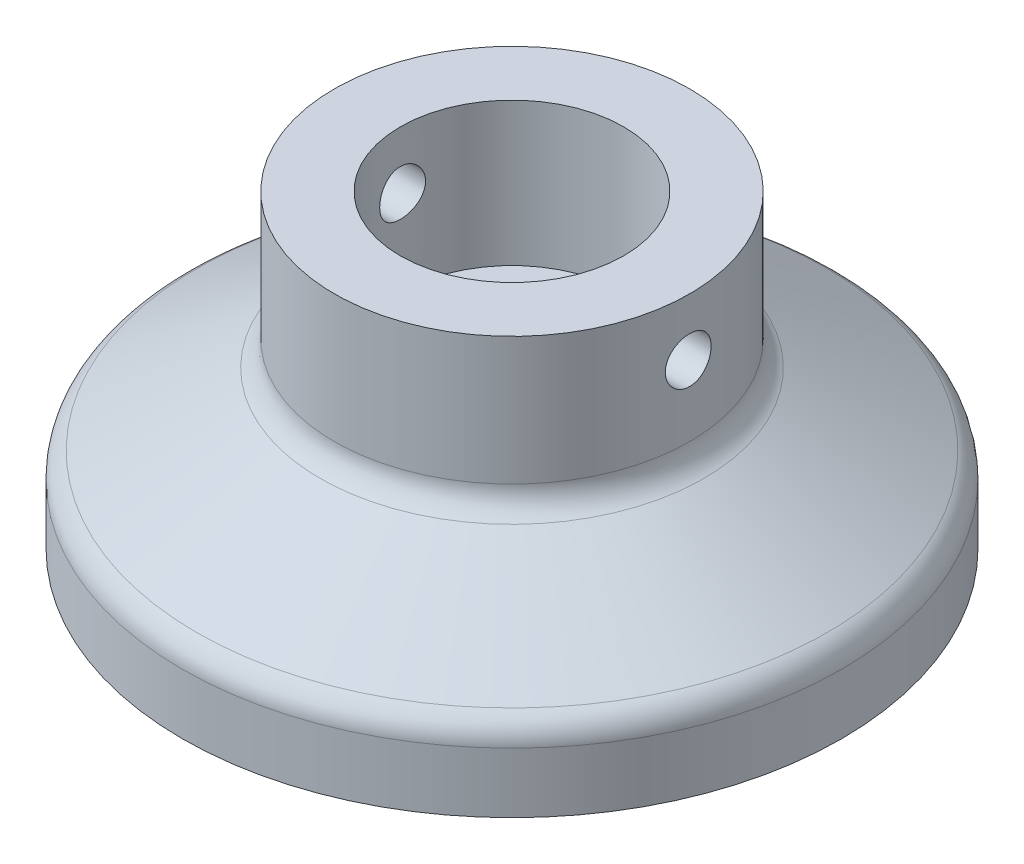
ISO-10303-21;
HEADER;
FILE_DESCRIPTION(('STEP AP214'),'2;1');
FILE_NAME('part.step','',(''),(''),'','','');
FILE_SCHEMA(('AUTOMOTIVE_DESIGN { 1 0 10303 214 1 1 1 1 }'));
ENDSEC;
DATA;
#1=APPLICATION_CONTEXT('core data for automotive mechanical design processes');
#2=APPLICATION_PROTOCOL_DEFINITION('international standard','automotive_design',2000,#1);
#3=PRODUCT_CONTEXT('',#1,'mechanical');
#4=PRODUCT('Part','Part','',(#3));
#5=PRODUCT_RELATED_PRODUCT_CATEGORY('part','',(#4));
#6=PRODUCT_DEFINITION_FORMATION('','',#4);
#7=PRODUCT_DEFINITION_CONTEXT('part definition',#1,'design');
#8=PRODUCT_DEFINITION('design','',#6,#7);
#9=PRODUCT_DEFINITION_SHAPE('','',#8);
#10=(LENGTH_UNIT() NAMED_UNIT(*) SI_UNIT(.MILLI.,.METRE.));
#11=(NAMED_UNIT(*) PLANE_ANGLE_UNIT() SI_UNIT($,.RADIAN.));
#12=(NAMED_UNIT(*) SI_UNIT($,.STERADIAN.) SOLID_ANGLE_UNIT());
#13=UNCERTAINTY_MEASURE_WITH_UNIT(LENGTH_MEASURE(1.E-05),#10,'distance_accuracy_value','');
#14=(GEOMETRIC_REPRESENTATION_CONTEXT(3) GLOBAL_UNCERTAINTY_ASSIGNED_CONTEXT((#13)) GLOBAL_UNIT_ASSIGNED_CONTEXT((#10,
#11,#12)) REPRESENTATION_CONTEXT('',''));
#15=CARTESIAN_POINT('',(0.,0.,0.));
#16=DIRECTION('',(0.,0.,1.));
#17=DIRECTION('',(1.,0.,0.));
#18=AXIS2_PLACEMENT_3D('',#15,#16,#17);
#19=CARTESIAN_POINT('',(0.,29.,0.));
#20=DIRECTION('',(0.,1.,0.));
#21=DIRECTION('',(0.,0.,1.));
#22=AXIS2_PLACEMENT_3D('',#19,#20,#21);
#23=PLANE('',#22);
#24=CARTESIAN_POINT('',(0.,29.,0.));
#25=DIRECTION('',(0.,-1.,0.));
#26=DIRECTION('',(0.,0.,-1.));
#27=AXIS2_PLACEMENT_3D('',#24,#25,#26);
#28=CIRCLE('',#27,19.5);
#29=CARTESIAN_POINT('',(0.,29.,-19.5));
#30=VERTEX_POINT('',#29);
#31=EDGE_CURVE('E54',#30,#30,#28,.T.);
#32=ORIENTED_EDGE('',*,*,#31,.F.);
#33=EDGE_LOOP('',(#32));
#34=FACE_BOUND('',#33,.T.);
#35=ADVANCED_FACE('F34',(#34),#23,.T.);
#36=CARTESIAN_POINT('',(0.,0.,0.));
#37=DIRECTION('',(0.,-1.,0.));
#38=DIRECTION('',(0.,0.,-1.));
#39=AXIS2_PLACEMENT_3D('',#36,#37,#38);
#40=CYLINDRICAL_SURFACE('',#39,19.5);
#41=CARTESIAN_POINT('',(-19.0853346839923,44.,-4.));
#42=CARTESIAN_POINT('',(-19.0853391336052,44.2221308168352,-3.99999193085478));
#43=CARTESIAN_POINT('',(-19.0892548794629,44.4443620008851,-3.98143384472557));
#44=CARTESIAN_POINT('',(-19.1044702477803,44.8825288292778,-3.9077588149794));
#45=CARTESIAN_POINT('',(-19.1157756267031,45.0984594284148,-3.85261336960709));
#46=CARTESIAN_POINT('',(-19.1444372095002,45.5176228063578,-3.70755288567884));
#47=CARTESIAN_POINT('',(-19.1617872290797,45.7208683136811,-3.61767337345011));
#48=CARTESIAN_POINT('',(-19.2005758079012,46.1093924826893,-3.40579458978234));
#49=CARTESIAN_POINT('',(-19.2220141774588,46.2946719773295,-3.28379680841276));
#50=CARTESIAN_POINT('',(-19.2669200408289,46.6447676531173,-3.0092107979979));
#51=CARTESIAN_POINT('',(-19.2904107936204,46.8092777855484,-2.8562360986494));
#52=CARTESIAN_POINT('',(-19.3365701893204,47.1104907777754,-2.5248734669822));
#53=CARTESIAN_POINT('',(-19.359238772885,47.247191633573,-2.34648370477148));
#54=CARTESIAN_POINT('',(-19.4014512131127,47.4900993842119,-1.96732132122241));
#55=CARTESIAN_POINT('',(-19.4209644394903,47.596014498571,-1.76635806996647));
#56=CARTESIAN_POINT('',(-19.4544058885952,47.772460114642,-1.34902021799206));
#57=CARTESIAN_POINT('',(-19.468334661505,47.8429941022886,-1.1326471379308));
#58=CARTESIAN_POINT('',(-19.4888734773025,47.9457199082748,-0.693809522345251));
#59=CARTESIAN_POINT('',(-19.4955821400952,47.9784288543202,-0.471470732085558));
#60=CARTESIAN_POINT('',(-19.5012657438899,48.0061904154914,-0.0243670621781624));
#61=CARTESIAN_POINT('',(-19.5002414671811,48.0012468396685,0.200397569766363));
#62=CARTESIAN_POINT('',(-19.4906507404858,47.9542340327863,0.642416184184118));
#63=CARTESIAN_POINT('',(-19.4821974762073,47.9127219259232,0.859732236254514));
#64=CARTESIAN_POINT('',(-19.4588265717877,47.7946352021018,1.28424679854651));
#65=CARTESIAN_POINT('',(-19.4439086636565,47.7180591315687,1.49144488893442));
#66=CARTESIAN_POINT('',(-19.4090993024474,47.5315082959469,1.89141991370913));
#67=CARTESIAN_POINT('',(-19.3891757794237,47.4213171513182,2.08409302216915));
#68=CARTESIAN_POINT('',(-19.3465484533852,47.1708245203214,2.4484193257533));
#69=CARTESIAN_POINT('',(-19.3238443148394,47.030519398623,2.62006997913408));
#70=CARTESIAN_POINT('',(-19.2776696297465,46.7207312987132,2.94078711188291));
#71=CARTESIAN_POINT('',(-19.2541926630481,46.5507607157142,3.08938205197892));
#72=CARTESIAN_POINT('',(-19.2095117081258,46.1880739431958,3.35603849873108));
#73=CARTESIAN_POINT('',(-19.1883077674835,45.9953572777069,3.47409936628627));
#74=CARTESIAN_POINT('',(-19.1505598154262,45.5919491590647,3.67651129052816));
#75=CARTESIAN_POINT('',(-19.1340268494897,45.3812166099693,3.76078263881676));
#76=CARTESIAN_POINT('',(-19.1076522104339,44.948164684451,3.89258150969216));
#77=CARTESIAN_POINT('',(-19.0978096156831,44.7258469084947,3.94011409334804));
#78=CARTESIAN_POINT('',(-19.0861156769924,44.2802183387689,3.99637437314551));
#79=CARTESIAN_POINT('',(-19.0841238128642,44.0569972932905,4.00578450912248));
#80=CARTESIAN_POINT('',(-19.0879791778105,43.6121753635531,3.98737214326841));
#81=CARTESIAN_POINT('',(-19.0938259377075,43.3905743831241,3.95955186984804));
#82=CARTESIAN_POINT('',(-19.1125678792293,42.9575986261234,3.86805775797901));
#83=CARTESIAN_POINT('',(-19.125390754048,42.7461427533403,3.80475152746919));
#84=CARTESIAN_POINT('',(-19.1565762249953,42.3368389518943,3.64447690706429));
#85=CARTESIAN_POINT('',(-19.1749392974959,42.1389921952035,3.54750562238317));
#86=CARTESIAN_POINT('',(-19.2154499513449,41.7595453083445,3.32111974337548));
#87=CARTESIAN_POINT('',(-19.2376458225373,41.5782041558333,3.1912798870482));
#88=CARTESIAN_POINT('',(-19.2831900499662,41.2396344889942,2.90340662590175));
#89=CARTESIAN_POINT('',(-19.3065385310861,41.0824085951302,2.74537016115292));
#90=CARTESIAN_POINT('',(-19.3522151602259,40.7939287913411,2.40251958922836));
#91=CARTESIAN_POINT('',(-19.374520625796,40.6631373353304,2.21731284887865));
#92=CARTESIAN_POINT('',(-19.4151976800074,40.4345263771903,1.82715915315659));
#93=CARTESIAN_POINT('',(-19.4335694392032,40.3367054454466,1.62221305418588));
#94=CARTESIAN_POINT('',(-19.4642125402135,40.1774784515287,1.19958764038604));
#95=CARTESIAN_POINT('',(-19.4765195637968,40.1158589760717,0.981991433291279));
#96=CARTESIAN_POINT('',(-19.4937999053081,40.0301102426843,0.539258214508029));
#97=CARTESIAN_POINT('',(-19.4987741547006,40.0059762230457,0.314122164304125));
#98=CARTESIAN_POINT('',(-19.5008049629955,39.9960758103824,-0.132890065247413));
#99=CARTESIAN_POINT('',(-19.4980047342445,40.0096154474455,-0.354750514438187));
#100=CARTESIAN_POINT('',(-19.4851038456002,40.0731404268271,-0.792962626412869));
#101=CARTESIAN_POINT('',(-19.475003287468,40.1231252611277,-1.00931436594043));
#102=CARTESIAN_POINT('',(-19.4486424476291,40.2578067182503,-1.42990738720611));
#103=CARTESIAN_POINT('',(-19.4323976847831,40.3424159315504,-1.63417769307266));
#104=CARTESIAN_POINT('',(-19.3954936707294,40.5438545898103,-2.02572024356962));
#105=CARTESIAN_POINT('',(-19.3748340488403,40.6606867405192,-2.21299105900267));
#106=CARTESIAN_POINT('',(-19.3309282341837,40.9255750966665,-2.56863801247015));
#107=CARTESIAN_POINT('',(-19.3076442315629,41.0741255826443,-2.73664137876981));
#108=CARTESIAN_POINT('',(-19.2613327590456,41.3972230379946,-3.04557393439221));
#109=CARTESIAN_POINT('',(-19.2383053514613,41.5717761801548,-3.18649667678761));
#110=CARTESIAN_POINT('',(-19.1948231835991,41.9443223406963,-3.4388058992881));
#111=CARTESIAN_POINT('',(-19.1744008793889,42.1425607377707,-3.54983592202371));
#112=CARTESIAN_POINT('',(-19.1388405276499,42.5552479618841,-3.73683222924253));
#113=CARTESIAN_POINT('',(-19.123697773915,42.769682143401,-3.8128297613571));
#114=CARTESIAN_POINT('',(-19.1033751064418,43.1537781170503,-3.91317471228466));
#115=CARTESIAN_POINT('',(-19.0966526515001,43.3212761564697,-3.94567484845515));
#116=CARTESIAN_POINT('',(-19.0876308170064,43.6591631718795,-3.98909017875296));
#117=CARTESIAN_POINT('',(-19.0853312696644,43.8295520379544,-4.00000619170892));
#118=CARTESIAN_POINT('',(-19.0853346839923,44.,-4.));
#119=B_SPLINE_CURVE_WITH_KNOTS('',3,(#41,#42,#43,#44,#45,#46,#47,#48,#49,#50,#51,#52,#53,#54,
#55,#56,#57,#58,#59,#60,#61,#62,#63,#64,#65,#66,#67,#68,#69,#70,#71,#72,#73,#74,#75,#76,#77,#78,
#79,#80,#81,#82,#83,#84,#85,#86,#87,#88,#89,#90,#91,#92,#93,#94,#95,#96,#97,#98,#99,#100,#101,
#102,#103,#104,#105,#106,#107,#108,#109,#110,#111,#112,#113,#114,#115,#116,#117,#118),
.UNSPECIFIED.,.T.,.F.,(4,2,2,2,2,2,2,2,2,2,2,2,2,2,2,2,2,2,2,2,2,2,2,2,2,2,2,2,2,2,2,2,2,2,2,2,
2,2,4),(0.,0.665768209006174,1.33205566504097,1.99766343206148,2.66324032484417,
3.33769854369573,4.01220534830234,4.69291078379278,5.3735491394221,6.04476778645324,
6.7159185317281,7.37701773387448,8.03814434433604,8.70361977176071,9.36917557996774,
10.0469286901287,10.7246959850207,11.4040528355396,12.0833160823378,12.7503644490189,
13.417372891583,14.0775960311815,14.7378759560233,15.4071793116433,16.0765553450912,
16.7567848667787,17.4369848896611,18.1131337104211,18.7891966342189,19.4528889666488,
20.116572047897,20.7785898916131,21.4406633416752,22.1139249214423,22.7873465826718,
23.4684746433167,24.1489939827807,24.6598782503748,25.1707431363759),.UNSPECIFIED.);
#120=CARTESIAN_POINT('',(-19.0853346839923,44.,-4.));
#121=VERTEX_POINT('',#120);
#122=EDGE_CURVE('E88',#121,#121,#119,.T.);
#123=ORIENTED_EDGE('',*,*,#122,.F.);
#124=EDGE_LOOP('',(#123));
#125=FACE_BOUND('',#124,.T.);
#126=CARTESIAN_POINT('',(19.0853346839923,44.,-4.));
#127=CARTESIAN_POINT('',(19.0853391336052,43.7778691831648,-3.99999193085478));
#128=CARTESIAN_POINT('',(19.0892548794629,43.5556379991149,-3.98143384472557));
#129=CARTESIAN_POINT('',(19.1044702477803,43.1174711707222,-3.9077588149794));
#130=CARTESIAN_POINT('',(19.1157756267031,42.9015405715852,-3.85261336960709));
#131=CARTESIAN_POINT('',(19.1444372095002,42.4823771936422,-3.70755288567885));
#132=CARTESIAN_POINT('',(19.1617872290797,42.2791316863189,-3.61767337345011));
#133=CARTESIAN_POINT('',(19.2005758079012,41.8906075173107,-3.40579458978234));
#134=CARTESIAN_POINT('',(19.2220141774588,41.7053280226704,-3.28379680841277));
#135=CARTESIAN_POINT('',(19.2669200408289,41.3552323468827,-3.0092107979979));
#136=CARTESIAN_POINT('',(19.2904107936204,41.1907222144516,-2.8562360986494));
#137=CARTESIAN_POINT('',(19.3365701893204,40.8895092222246,-2.5248734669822));
#138=CARTESIAN_POINT('',(19.359238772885,40.752808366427,-2.34648370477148));
#139=CARTESIAN_POINT('',(19.4014512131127,40.5099006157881,-1.96732132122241));
#140=CARTESIAN_POINT('',(19.4209644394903,40.403985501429,-1.76635806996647));
#141=CARTESIAN_POINT('',(19.4544058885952,40.227539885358,-1.34902021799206));
#142=CARTESIAN_POINT('',(19.468334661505,40.1570058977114,-1.1326471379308));
#143=CARTESIAN_POINT('',(19.4888734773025,40.0542800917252,-0.693809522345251));
#144=CARTESIAN_POINT('',(19.4955821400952,40.0215711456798,-0.471470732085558));
#145=CARTESIAN_POINT('',(19.5012657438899,39.9938095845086,-0.0243670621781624));
#146=CARTESIAN_POINT('',(19.5002414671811,39.9987531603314,0.200397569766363));
#147=CARTESIAN_POINT('',(19.4906507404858,40.0457659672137,0.642416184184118));
#148=CARTESIAN_POINT('',(19.4821974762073,40.0872780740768,0.859732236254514));
#149=CARTESIAN_POINT('',(19.4588265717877,40.2053647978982,1.28424679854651));
#150=CARTESIAN_POINT('',(19.4439086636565,40.2819408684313,1.49144488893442));
#151=CARTESIAN_POINT('',(19.4090993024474,40.4684917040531,1.89141991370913));
#152=CARTESIAN_POINT('',(19.3891757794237,40.5786828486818,2.08409302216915));
#153=CARTESIAN_POINT('',(19.3465484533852,40.8291754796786,2.4484193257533));
#154=CARTESIAN_POINT('',(19.3238443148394,40.969480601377,2.62006997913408));
#155=CARTESIAN_POINT('',(19.2776696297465,41.2792687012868,2.94078711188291));
#156=CARTESIAN_POINT('',(19.2541926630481,41.4492392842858,3.08938205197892));
#157=CARTESIAN_POINT('',(19.2095117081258,41.8119260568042,3.35603849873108));
#158=CARTESIAN_POINT('',(19.1883077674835,42.0046427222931,3.47409936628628));
#159=CARTESIAN_POINT('',(19.1505598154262,42.4080508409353,3.67651129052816));
#160=CARTESIAN_POINT('',(19.1340268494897,42.6187833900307,3.76078263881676));
#161=CARTESIAN_POINT('',(19.1076522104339,43.051835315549,3.89258150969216));
#162=CARTESIAN_POINT('',(19.0978096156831,43.2741530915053,3.94011409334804));
#163=CARTESIAN_POINT('',(19.0861156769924,43.7197816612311,3.99637437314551));
#164=CARTESIAN_POINT('',(19.0841238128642,43.9430027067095,4.00578450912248));
#165=CARTESIAN_POINT('',(19.0879791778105,44.3878246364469,3.98737214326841));
#166=CARTESIAN_POINT('',(19.0938259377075,44.6094256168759,3.95955186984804));
#167=CARTESIAN_POINT('',(19.1125678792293,45.0424013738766,3.86805775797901));
#168=CARTESIAN_POINT('',(19.125390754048,45.2538572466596,3.80475152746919));
#169=CARTESIAN_POINT('',(19.1565762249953,45.6631610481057,3.64447690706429));
#170=CARTESIAN_POINT('',(19.1749392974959,45.8610078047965,3.54750562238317));
#171=CARTESIAN_POINT('',(19.2154499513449,46.2404546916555,3.32111974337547));
#172=CARTESIAN_POINT('',(19.2376458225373,46.4217958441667,3.1912798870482));
#173=CARTESIAN_POINT('',(19.2831900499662,46.7603655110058,2.90340662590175));
#174=CARTESIAN_POINT('',(19.3065385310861,46.9175914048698,2.74537016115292));
#175=CARTESIAN_POINT('',(19.3522151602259,47.2060712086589,2.40251958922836));
#176=CARTESIAN_POINT('',(19.374520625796,47.3368626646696,2.21731284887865));
#177=CARTESIAN_POINT('',(19.4151976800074,47.5654736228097,1.82715915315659));
#178=CARTESIAN_POINT('',(19.4335694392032,47.6632945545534,1.62221305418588));
#179=CARTESIAN_POINT('',(19.4642125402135,47.8225215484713,1.19958764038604));
#180=CARTESIAN_POINT('',(19.4765195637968,47.8841410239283,0.981991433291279));
#181=CARTESIAN_POINT('',(19.4937999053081,47.9698897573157,0.539258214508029));
#182=CARTESIAN_POINT('',(19.4987741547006,47.9940237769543,0.314122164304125));
#183=CARTESIAN_POINT('',(19.5008049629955,48.0039241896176,-0.132890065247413));
#184=CARTESIAN_POINT('',(19.4980047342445,47.9903845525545,-0.354750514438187));
#185=CARTESIAN_POINT('',(19.4851038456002,47.9268595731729,-0.792962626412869));
#186=CARTESIAN_POINT('',(19.475003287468,47.8768747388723,-1.00931436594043));
#187=CARTESIAN_POINT('',(19.4486424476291,47.7421932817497,-1.42990738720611));
#188=CARTESIAN_POINT('',(19.4323976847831,47.6575840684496,-1.63417769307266));
#189=CARTESIAN_POINT('',(19.3954936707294,47.4561454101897,-2.02572024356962));
#190=CARTESIAN_POINT('',(19.3748340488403,47.3393132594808,-2.21299105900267));
#191=CARTESIAN_POINT('',(19.3309282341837,47.0744249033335,-2.56863801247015));
#192=CARTESIAN_POINT('',(19.3076442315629,46.9258744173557,-2.73664137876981));
#193=CARTESIAN_POINT('',(19.2613327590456,46.6027769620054,-3.04557393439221));
#194=CARTESIAN_POINT('',(19.2383053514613,46.4282238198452,-3.18649667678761));
#195=CARTESIAN_POINT('',(19.1948231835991,46.0556776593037,-3.4388058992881));
#196=CARTESIAN_POINT('',(19.1744008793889,45.8574392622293,-3.5498359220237));
#197=CARTESIAN_POINT('',(19.1388405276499,45.4447520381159,-3.73683222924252));
#198=CARTESIAN_POINT('',(19.123697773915,45.230317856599,-3.8128297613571));
#199=CARTESIAN_POINT('',(19.1033751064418,44.8462218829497,-3.91317471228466));
#200=CARTESIAN_POINT('',(19.0966526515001,44.6787238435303,-3.94567484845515));
#201=CARTESIAN_POINT('',(19.0876308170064,44.3408368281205,-3.98909017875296));
#202=CARTESIAN_POINT('',(19.0853312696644,44.1704479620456,-4.00000619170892));
#203=CARTESIAN_POINT('',(19.0853346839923,44.,-4.));
#204=B_SPLINE_CURVE_WITH_KNOTS('',3,(#126,#127,#128,#129,#130,#131,#132,#133,#134,#135,#136,
#137,#138,#139,#140,#141,#142,#143,#144,#145,#146,#147,#148,#149,#150,#151,#152,#153,#154,#155,
#156,#157,#158,#159,#160,#161,#162,#163,#164,#165,#166,#167,#168,#169,#170,#171,#172,#173,#174,
#175,#176,#177,#178,#179,#180,#181,#182,#183,#184,#185,#186,#187,#188,#189,#190,#191,#192,#193,
#194,#195,#196,#197,#198,#199,#200,#201,#202,#203),.UNSPECIFIED.,.T.,.F.,(4,2,2,2,2,2,2,2,2,2,2,
2,2,2,2,2,2,2,2,2,2,2,2,2,2,2,2,2,2,2,2,2,2,2,2,2,2,2,4),(0.,0.665768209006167,1.33205566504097,
1.99766343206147,2.66324032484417,3.33769854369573,4.01220534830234,4.69291078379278,
5.3735491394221,6.04476778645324,6.7159185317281,7.37701773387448,8.03814434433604,
8.70361977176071,9.36917557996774,10.0469286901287,10.7246959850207,11.4040528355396,
12.0833160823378,12.7503644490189,13.417372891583,14.0775960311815,14.7378759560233,
15.4071793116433,16.0765553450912,16.7567848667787,17.4369848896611,18.1131337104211,
18.7891966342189,19.4528889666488,20.116572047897,20.7785898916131,21.4406633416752,
22.1139249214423,22.7873465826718,23.4684746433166,24.1489939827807,24.6598782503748,
25.1707431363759),.UNSPECIFIED.);
#205=CARTESIAN_POINT('',(19.0853346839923,44.,-4.));
#206=VERTEX_POINT('',#205);
#207=EDGE_CURVE('E62',#206,#206,#204,.T.);
#208=ORIENTED_EDGE('',*,*,#207,.F.);
#209=EDGE_LOOP('',(#208));
#210=FACE_BOUND('',#209,.T.);
#211=ORIENTED_EDGE('',*,*,#31,.T.);
#212=EDGE_LOOP('',(#211));
#213=FACE_BOUND('',#212,.T.);
#214=CARTESIAN_POINT('',(0.,54.,0.));
#215=DIRECTION('',(0.,-1.,0.));
#216=DIRECTION('',(0.,0.,-1.));
#217=AXIS2_PLACEMENT_3D('',#214,#215,#216);
#218=CIRCLE('',#217,19.5);
#219=CARTESIAN_POINT('',(0.,54.,-19.5));
#220=VERTEX_POINT('',#219);
#221=EDGE_CURVE('E127',#220,#220,#218,.T.);
#222=ORIENTED_EDGE('',*,*,#221,.F.);
#223=EDGE_LOOP('',(#222));
#224=FACE_BOUND('',#223,.T.);
#225=ADVANCED_FACE('F92',(#125,#210,#213,#224),#40,.F.);
#226=CARTESIAN_POINT('',(19.5,54.,0.));
#227=DIRECTION('',(0.,1.,0.));
#228=DIRECTION('',(0.,0.,1.));
#229=AXIS2_PLACEMENT_3D('',#226,#227,#228);
#230=PLANE('',#229);
#231=ORIENTED_EDGE('',*,*,#221,.T.);
#232=EDGE_LOOP('',(#231));
#233=FACE_BOUND('',#232,.T.);
#234=CARTESIAN_POINT('',(0.,54.,0.));
#235=DIRECTION('',(0.,-1.,0.));
#236=DIRECTION('',(0.,0.,-1.));
#237=AXIS2_PLACEMENT_3D('',#234,#235,#236);
#238=CIRCLE('',#237,31.);
#239=CARTESIAN_POINT('',(0.,54.,-31.));
#240=VERTEX_POINT('',#239);
#241=EDGE_CURVE('E123',#240,#240,#238,.T.);
#242=ORIENTED_EDGE('',*,*,#241,.F.);
#243=EDGE_LOOP('',(#242));
#244=FACE_BOUND('',#243,.T.);
#245=ADVANCED_FACE('F96',(#233,#244),#230,.T.);
#246=CARTESIAN_POINT('',(0.,0.,0.));
#247=DIRECTION('',(0.,-1.,0.));
#248=DIRECTION('',(0.,0.,-1.));
#249=AXIS2_PLACEMENT_3D('',#246,#247,#248);
#250=CYLINDRICAL_SURFACE('',#249,31.);
#251=CARTESIAN_POINT('',(0.,31.6727874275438,0.));
#252=DIRECTION('',(0.,-1.,0.));
#253=DIRECTION('',(0.,0.,-1.));
#254=AXIS2_PLACEMENT_3D('',#251,#252,#253);
#255=CIRCLE('',#254,31.);
#256=CARTESIAN_POINT('',(0.,31.6727874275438,-31.));
#257=VERTEX_POINT('',#256);
#258=EDGE_CURVE('E11',#257,#257,#255,.F.);
#259=ORIENTED_EDGE('',*,*,#258,.T.);
#260=EDGE_LOOP('',(#259));
#261=FACE_BOUND('',#260,.T.);
#262=CARTESIAN_POINT('',(-30.7408522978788,44.,-4.));
#263=CARTESIAN_POINT('',(-30.7408556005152,43.7763239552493,-3.99999052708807));
#264=CARTESIAN_POINT('',(-30.7433199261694,43.5525095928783,-3.98117505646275));
#265=CARTESIAN_POINT('',(-30.7529068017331,43.1111139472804,-3.9064163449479));
#266=CARTESIAN_POINT('',(-30.7600341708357,42.8935393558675,-3.85043469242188));
#267=CARTESIAN_POINT('',(-30.7781267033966,42.4710776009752,-3.7030251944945));
#268=CARTESIAN_POINT('',(-30.7890892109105,42.266181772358,-3.6116218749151));
#269=CARTESIAN_POINT('',(-30.8136136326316,41.8746735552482,-3.39601698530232));
#270=CARTESIAN_POINT('',(-30.8271751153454,41.6880581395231,-3.27182085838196));
#271=CARTESIAN_POINT('',(-30.8554598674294,41.3372599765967,-2.99336401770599));
#272=CARTESIAN_POINT('',(-30.8701889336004,41.1732018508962,-2.83894687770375));
#273=CARTESIAN_POINT('',(-30.8990971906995,40.873252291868,-2.50476828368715));
#274=CARTESIAN_POINT('',(-30.9132763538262,40.7373622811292,-2.32500555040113));
#275=CARTESIAN_POINT('',(-30.9395467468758,40.4971572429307,-1.94445279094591));
#276=CARTESIAN_POINT('',(-30.9516304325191,40.3929553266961,-1.74359080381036));
#277=CARTESIAN_POINT('',(-30.9722845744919,40.2198090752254,-1.32703620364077));
#278=CARTESIAN_POINT('',(-30.9808551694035,40.1508633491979,-1.11134417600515));
#279=CARTESIAN_POINT('',(-30.9934766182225,40.0505598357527,-0.67252836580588));
#280=CARTESIAN_POINT('',(-30.9975524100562,40.01899458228,-0.44945273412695));
#281=CARTESIAN_POINT('',(-31.0008102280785,39.9937048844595,-0.0011359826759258));
#282=CARTESIAN_POINT('',(-30.9999924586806,39.9999788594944,0.224105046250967));
#283=CARTESIAN_POINT('',(-30.9935754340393,40.0500236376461,0.668946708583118));
#284=CARTESIAN_POINT('',(-30.9880046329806,40.0935713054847,0.888572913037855));
#285=CARTESIAN_POINT('',(-30.9727393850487,40.2165782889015,1.31737376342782));
#286=CARTESIAN_POINT('',(-30.9630448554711,40.2960383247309,1.52654819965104));
#287=CARTESIAN_POINT('',(-30.9405724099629,40.4888504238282,1.92919629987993));
#288=CARTESIAN_POINT('',(-30.9277857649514,40.6022986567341,2.12262340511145));
#289=CARTESIAN_POINT('',(-30.9005588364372,40.8597967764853,2.48777829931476));
#290=CARTESIAN_POINT('',(-30.886118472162,41.0038481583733,2.65950502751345));
#291=CARTESIAN_POINT('',(-30.8570752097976,41.3197122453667,2.9776960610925));
#292=CARTESIAN_POINT('',(-30.8424718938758,41.4917194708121,3.12396729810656));
#293=CARTESIAN_POINT('',(-30.8148522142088,41.8579454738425,3.38559366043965));
#294=CARTESIAN_POINT('',(-30.8018358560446,42.0521643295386,3.50094867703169));
#295=CARTESIAN_POINT('',(-30.7788640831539,42.4574768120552,3.69748136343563));
#296=CARTESIAN_POINT('',(-30.7689101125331,42.6685783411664,3.77864291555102));
#297=CARTESIAN_POINT('',(-30.7532178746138,43.1015714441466,3.90431016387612));
#298=CARTESIAN_POINT('',(-30.7474793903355,43.3234624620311,3.94881774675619));
#299=CARTESIAN_POINT('',(-30.7409077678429,43.7700288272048,3.99965660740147));
#300=CARTESIAN_POINT('',(-30.7400396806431,43.9946727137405,4.00625988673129));
#301=CARTESIAN_POINT('',(-30.7432146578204,44.4418635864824,3.98182098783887));
#302=CARTESIAN_POINT('',(-30.7472576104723,44.6644106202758,3.95077966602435));
#303=CARTESIAN_POINT('',(-30.7597672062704,45.100271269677,3.85216198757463));
#304=CARTESIAN_POINT('',(-30.7682178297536,45.3136153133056,3.78471790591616));
#305=CARTESIAN_POINT('',(-30.7885775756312,45.7259669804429,3.61534557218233));
#306=CARTESIAN_POINT('',(-30.8004868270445,45.924974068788,3.51341603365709));
#307=CARTESIAN_POINT('',(-30.8265054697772,46.3042316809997,3.27729970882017));
#308=CARTESIAN_POINT('',(-30.8406268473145,46.4843705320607,3.14293489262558));
#309=CARTESIAN_POINT('',(-30.86944122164,46.819637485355,2.84601317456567));
#310=CARTESIAN_POINT('',(-30.8841342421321,46.9747645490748,2.68345510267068));
#311=CARTESIAN_POINT('',(-30.9125440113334,47.2565631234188,2.33357163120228));
#312=CARTESIAN_POINT('',(-30.9262542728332,47.3830556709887,2.14610149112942));
#313=CARTESIAN_POINT('',(-30.9510561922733,47.6027549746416,1.7524174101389));
#314=CARTESIAN_POINT('',(-30.9621479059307,47.6959624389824,1.54620386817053));
#315=CARTESIAN_POINT('',(-30.9804342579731,47.8461516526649,1.1214759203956));
#316=CARTESIAN_POINT('',(-30.9876399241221,47.9032359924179,0.902998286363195));
#317=CARTESIAN_POINT('',(-30.9973881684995,47.9798920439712,0.459459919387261));
#318=CARTESIAN_POINT('',(-30.9999309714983,47.9994655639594,0.234399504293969));
#319=CARTESIAN_POINT('',(-31.0000657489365,48.000509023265,-0.214170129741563));
#320=CARTESIAN_POINT('',(-30.9976935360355,47.9822545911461,-0.437678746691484));
#321=CARTESIAN_POINT('',(-30.9883361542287,47.9087451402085,-0.878422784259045));
#322=CARTESIAN_POINT('',(-30.9813509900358,47.8534901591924,-1.09565821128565));
#323=CARTESIAN_POINT('',(-30.9635489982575,47.707636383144,-1.51764724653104));
#324=CARTESIAN_POINT('',(-30.9527336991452,47.6170516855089,-1.72240579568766));
#325=CARTESIAN_POINT('',(-30.9284675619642,47.403138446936,-2.11385938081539));
#326=CARTESIAN_POINT('',(-30.9150166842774,47.279809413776,-2.3005541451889));
#327=CARTESIAN_POINT('',(-30.8868630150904,47.0028918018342,-2.65198741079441));
#328=CARTESIAN_POINT('',(-30.8721521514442,46.8490983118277,-2.81656381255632));
#329=CARTESIAN_POINT('',(-30.8432005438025,46.5160445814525,-3.11767933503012));
#330=CARTESIAN_POINT('',(-30.8289599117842,46.3367783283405,-3.25421181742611));
#331=CARTESIAN_POINT('',(-30.8024986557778,45.9570178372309,-3.49584858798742));
#332=CARTESIAN_POINT('',(-30.7902865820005,45.756439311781,-3.60082128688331));
#333=CARTESIAN_POINT('',(-30.7693652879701,45.3404524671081,-3.77544209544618));
#334=CARTESIAN_POINT('',(-30.7606522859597,45.1250604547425,-3.8451283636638));
#335=CARTESIAN_POINT('',(-30.7498160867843,44.7571453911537,-3.93064302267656));
#336=CARTESIAN_POINT('',(-30.7464715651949,44.6069364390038,-3.95661413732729));
#337=CARTESIAN_POINT('',(-30.741988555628,44.3045063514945,-3.99129577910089));
#338=CARTESIAN_POINT('',(-30.7408500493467,44.152285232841,-4.00000644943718));
#339=CARTESIAN_POINT('',(-30.7408522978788,44.,-4.));
#340=B_SPLINE_CURVE_WITH_KNOTS('',3,(#262,#263,#264,#265,#266,#267,#268,#269,#270,#271,#272,
#273,#274,#275,#276,#277,#278,#279,#280,#281,#282,#283,#284,#285,#286,#287,#288,#289,#290,#291,
#292,#293,#294,#295,#296,#297,#298,#299,#300,#301,#302,#303,#304,#305,#306,#307,#308,#309,#310,
#311,#312,#313,#314,#315,#316,#317,#318,#319,#320,#321,#322,#323,#324,#325,#326,#327,#328,#329,
#330,#331,#332,#333,#334,#335,#336,#337,#338,#339),.UNSPECIFIED.,.T.,.F.,(4,2,2,2,2,2,2,2,2,2,2,
2,2,2,2,2,2,2,2,2,2,2,2,2,2,2,2,2,2,2,2,2,2,2,2,2,2,2,4),(0.,0.670471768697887,1.34163755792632,
2.01233946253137,2.68293011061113,3.35708824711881,4.03128042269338,4.70785163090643,
5.38439614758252,6.05716789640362,6.72991154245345,7.39865581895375,8.0674135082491,
8.73808161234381,9.40878248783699,10.0843674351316,10.75995475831,11.4358601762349,
12.111730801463,12.7827452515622,13.4537444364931,14.122321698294,14.7909239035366,
15.4632828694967,16.135669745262,16.8121495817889,17.4886150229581,18.1631505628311,
18.8376535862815,19.5072592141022,20.1768641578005,20.8462021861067,21.5155502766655,
22.1895635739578,22.8637362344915,23.5406820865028,24.2168943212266,24.6733750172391,
25.1298519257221),.UNSPECIFIED.);
#341=CARTESIAN_POINT('',(-30.7408522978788,44.,-4.));
#342=VERTEX_POINT('',#341);
#343=EDGE_CURVE('E55',#342,#342,#340,.T.);
#344=ORIENTED_EDGE('',*,*,#343,.F.);
#345=EDGE_LOOP('',(#344));
#346=FACE_BOUND('',#345,.T.);
#347=CARTESIAN_POINT('',(30.7408522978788,44.,-4.));
#348=CARTESIAN_POINT('',(30.7408556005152,44.2236760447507,-3.99999052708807));
#349=CARTESIAN_POINT('',(30.7433199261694,44.4474904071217,-3.98117505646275));
#350=CARTESIAN_POINT('',(30.7529068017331,44.8888860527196,-3.9064163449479));
#351=CARTESIAN_POINT('',(30.7600341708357,45.1064606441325,-3.85043469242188));
#352=CARTESIAN_POINT('',(30.7781267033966,45.5289223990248,-3.7030251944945));
#353=CARTESIAN_POINT('',(30.7890892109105,45.733818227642,-3.6116218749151));
#354=CARTESIAN_POINT('',(30.8136136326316,46.1253264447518,-3.39601698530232));
#355=CARTESIAN_POINT('',(30.8271751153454,46.3119418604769,-3.27182085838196));
#356=CARTESIAN_POINT('',(30.8554598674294,46.6627400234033,-2.99336401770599));
#357=CARTESIAN_POINT('',(30.8701889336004,46.8267981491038,-2.83894687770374));
#358=CARTESIAN_POINT('',(30.8990971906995,47.126747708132,-2.50476828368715));
#359=CARTESIAN_POINT('',(30.9132763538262,47.2626377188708,-2.32500555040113));
#360=CARTESIAN_POINT('',(30.9395467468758,47.5028427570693,-1.94445279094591));
#361=CARTESIAN_POINT('',(30.9516304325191,47.6070446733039,-1.74359080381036));
#362=CARTESIAN_POINT('',(30.9722845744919,47.7801909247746,-1.32703620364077));
#363=CARTESIAN_POINT('',(30.9808551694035,47.8491366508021,-1.11134417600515));
#364=CARTESIAN_POINT('',(30.9934766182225,47.9494401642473,-0.67252836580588));
#365=CARTESIAN_POINT('',(30.9975524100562,47.98100541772,-0.44945273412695));
#366=CARTESIAN_POINT('',(31.0008102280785,48.0062951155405,-0.00113598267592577));
#367=CARTESIAN_POINT('',(30.9999924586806,48.0000211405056,0.224105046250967));
#368=CARTESIAN_POINT('',(30.9935754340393,47.9499763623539,0.668946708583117));
#369=CARTESIAN_POINT('',(30.9880046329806,47.9064286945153,0.888572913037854));
#370=CARTESIAN_POINT('',(30.9727393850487,47.7834217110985,1.31737376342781));
#371=CARTESIAN_POINT('',(30.9630448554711,47.7039616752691,1.52654819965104));
#372=CARTESIAN_POINT('',(30.9405724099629,47.5111495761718,1.92919629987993));
#373=CARTESIAN_POINT('',(30.9277857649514,47.3977013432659,2.12262340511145));
#374=CARTESIAN_POINT('',(30.9005588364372,47.1402032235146,2.48777829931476));
#375=CARTESIAN_POINT('',(30.886118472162,46.9961518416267,2.65950502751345));
#376=CARTESIAN_POINT('',(30.8570752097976,46.6802877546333,2.9776960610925));
#377=CARTESIAN_POINT('',(30.8424718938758,46.5082805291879,3.12396729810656));
#378=CARTESIAN_POINT('',(30.8148522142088,46.1420545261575,3.38559366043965));
#379=CARTESIAN_POINT('',(30.8018358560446,45.9478356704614,3.50094867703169));
#380=CARTESIAN_POINT('',(30.7788640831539,45.5425231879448,3.69748136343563));
#381=CARTESIAN_POINT('',(30.7689101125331,45.3314216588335,3.77864291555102));
#382=CARTESIAN_POINT('',(30.7532178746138,44.8984285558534,3.90431016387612));
#383=CARTESIAN_POINT('',(30.7474793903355,44.6765375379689,3.94881774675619));
#384=CARTESIAN_POINT('',(30.7409077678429,44.2299711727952,3.99965660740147));
#385=CARTESIAN_POINT('',(30.7400396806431,44.0053272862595,4.00625988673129));
#386=CARTESIAN_POINT('',(30.7432146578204,43.5581364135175,3.98182098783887));
#387=CARTESIAN_POINT('',(30.7472576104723,43.3355893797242,3.95077966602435));
#388=CARTESIAN_POINT('',(30.7597672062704,42.899728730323,3.85216198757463));
#389=CARTESIAN_POINT('',(30.7682178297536,42.6863846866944,3.78471790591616));
#390=CARTESIAN_POINT('',(30.7885775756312,42.2740330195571,3.61534557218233));
#391=CARTESIAN_POINT('',(30.8004868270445,42.0750259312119,3.51341603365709));
#392=CARTESIAN_POINT('',(30.8265054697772,41.6957683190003,3.27729970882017));
#393=CARTESIAN_POINT('',(30.8406268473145,41.5156294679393,3.14293489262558));
#394=CARTESIAN_POINT('',(30.86944122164,41.180362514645,2.84601317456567));
#395=CARTESIAN_POINT('',(30.8841342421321,41.0252354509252,2.68345510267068));
#396=CARTESIAN_POINT('',(30.9125440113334,40.7434368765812,2.33357163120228));
#397=CARTESIAN_POINT('',(30.9262542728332,40.6169443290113,2.14610149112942));
#398=CARTESIAN_POINT('',(30.9510561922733,40.3972450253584,1.7524174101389));
#399=CARTESIAN_POINT('',(30.9621479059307,40.3040375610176,1.54620386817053));
#400=CARTESIAN_POINT('',(30.9804342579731,40.1538483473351,1.1214759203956));
#401=CARTESIAN_POINT('',(30.9876399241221,40.0967640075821,0.902998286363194));
#402=CARTESIAN_POINT('',(30.9973881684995,40.0201079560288,0.45945991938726));
#403=CARTESIAN_POINT('',(30.9999309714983,40.0005344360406,0.234399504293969));
#404=CARTESIAN_POINT('',(31.0000657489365,39.999490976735,-0.214170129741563));
#405=CARTESIAN_POINT('',(30.9976935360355,40.0177454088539,-0.437678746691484));
#406=CARTESIAN_POINT('',(30.9883361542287,40.0912548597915,-0.878422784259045));
#407=CARTESIAN_POINT('',(30.9813509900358,40.1465098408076,-1.09565821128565));
#408=CARTESIAN_POINT('',(30.9635489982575,40.292363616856,-1.51764724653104));
#409=CARTESIAN_POINT('',(30.9527336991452,40.3829483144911,-1.72240579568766));
#410=CARTESIAN_POINT('',(30.9284675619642,40.596861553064,-2.11385938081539));
#411=CARTESIAN_POINT('',(30.9150166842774,40.720190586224,-2.3005541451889));
#412=CARTESIAN_POINT('',(30.8868630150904,40.9971081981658,-2.65198741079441));
#413=CARTESIAN_POINT('',(30.8721521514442,41.1509016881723,-2.81656381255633));
#414=CARTESIAN_POINT('',(30.8432005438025,41.4839554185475,-3.11767933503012));
#415=CARTESIAN_POINT('',(30.8289599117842,41.6632216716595,-3.25421181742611));
#416=CARTESIAN_POINT('',(30.8024986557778,42.0429821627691,-3.49584858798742));
#417=CARTESIAN_POINT('',(30.7902865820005,42.243560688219,-3.60082128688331));
#418=CARTESIAN_POINT('',(30.7693652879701,42.6595475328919,-3.77544209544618));
#419=CARTESIAN_POINT('',(30.7606522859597,42.8749395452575,-3.8451283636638));
#420=CARTESIAN_POINT('',(30.7498160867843,43.2428546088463,-3.93064302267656));
#421=CARTESIAN_POINT('',(30.7464715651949,43.3930635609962,-3.95661413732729));
#422=CARTESIAN_POINT('',(30.741988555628,43.6954936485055,-3.99129577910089));
#423=CARTESIAN_POINT('',(30.7408500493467,43.847714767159,-4.00000644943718));
#424=CARTESIAN_POINT('',(30.7408522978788,44.,-4.));
#425=B_SPLINE_CURVE_WITH_KNOTS('',3,(#347,#348,#349,#350,#351,#352,#353,#354,#355,#356,#357,
#358,#359,#360,#361,#362,#363,#364,#365,#366,#367,#368,#369,#370,#371,#372,#373,#374,#375,#376,
#377,#378,#379,#380,#381,#382,#383,#384,#385,#386,#387,#388,#389,#390,#391,#392,#393,#394,#395,
#396,#397,#398,#399,#400,#401,#402,#403,#404,#405,#406,#407,#408,#409,#410,#411,#412,#413,#414,
#415,#416,#417,#418,#419,#420,#421,#422,#423,#424),.UNSPECIFIED.,.T.,.F.,(4,2,2,2,2,2,2,2,2,2,2,
2,2,2,2,2,2,2,2,2,2,2,2,2,2,2,2,2,2,2,2,2,2,2,2,2,2,2,4),(0.,0.670471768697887,1.34163755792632,
2.01233946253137,2.68293011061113,3.35708824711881,4.03128042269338,4.70785163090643,
5.38439614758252,6.05716789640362,6.72991154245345,7.39865581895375,8.0674135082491,
8.73808161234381,9.40878248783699,10.0843674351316,10.75995475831,11.4358601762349,
12.111730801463,12.7827452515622,13.4537444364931,14.122321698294,14.7909239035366,
15.4632828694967,16.135669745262,16.8121495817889,17.4886150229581,18.1631505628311,
18.8376535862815,19.5072592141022,20.1768641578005,20.8462021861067,21.5155502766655,
22.1895635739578,22.8637362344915,23.5406820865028,24.2168943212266,24.6733750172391,
25.1298519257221),.UNSPECIFIED.);
#426=CARTESIAN_POINT('',(30.7408522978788,44.,-4.));
#427=VERTEX_POINT('',#426);
#428=EDGE_CURVE('E63',#427,#427,#425,.T.);
#429=ORIENTED_EDGE('',*,*,#428,.F.);
#430=EDGE_LOOP('',(#429));
#431=FACE_BOUND('',#430,.T.);
#432=ORIENTED_EDGE('',*,*,#241,.T.);
#433=EDGE_LOOP('',(#432));
#434=FACE_BOUND('',#433,.T.);
#435=ADVANCED_FACE('F67',(#261,#346,#431,#434),#250,.T.);
#436=CARTESIAN_POINT('',(0.,13.3789916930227,0.));
#437=DIRECTION('',(0.,-1.,0.));
#438=DIRECTION('',(0.,0.,-1.));
#439=AXIS2_PLACEMENT_3D('',#436,#437,#438);
#440=CONICAL_SURFACE('',#439,57.5,1.04385309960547);
#441=CARTESIAN_POINT('',(0.,14.8251194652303,0.));
#442=DIRECTION('',(0.,1.,0.));
#443=DIRECTION('',(0.,0.,1.));
#444=AXIS2_PLACEMENT_3D('',#441,#442,#443);
#445=CIRCLE('',#444,55.0144678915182);
#446=CARTESIAN_POINT('',(0.,14.8251194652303,55.0144678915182));
#447=VERTEX_POINT('',#446);
#448=EDGE_CURVE('E41',#447,#447,#445,.T.);
#449=ORIENTED_EDGE('',*,*,#448,.T.);
#450=EDGE_LOOP('',(#449));
#451=FACE_BOUND('',#450,.T.);
#452=CARTESIAN_POINT('',(0.,27.3510457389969,0.));
#453=DIRECTION('',(0.,-1.,0.));
#454=DIRECTION('',(0.,0.,-1.));
#455=AXIS2_PLACEMENT_3D('',#452,#453,#454);
#456=CIRCLE('',#455,33.4855321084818);
#457=CARTESIAN_POINT('',(0.,27.3510457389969,-33.4855321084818));
#458=VERTEX_POINT('',#457);
#459=EDGE_CURVE('E45',#458,#458,#456,.T.);
#460=ORIENTED_EDGE('',*,*,#459,.T.);
#461=EDGE_LOOP('',(#460));
#462=FACE_BOUND('',#461,.T.);
#463=ADVANCED_FACE('F117',(#451,#462),#440,.T.);
#464=CARTESIAN_POINT('',(0.,0.,0.));
#465=DIRECTION('',(0.,-1.,0.));
#466=DIRECTION('',(0.,0.,-1.));
#467=AXIS2_PLACEMENT_3D('',#464,#465,#466);
#468=CYLINDRICAL_SURFACE('',#467,57.5);
#469=CARTESIAN_POINT('',(0.,10.5033777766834,0.));
#470=DIRECTION('',(0.,1.,0.));
#471=DIRECTION('',(0.,0.,1.));
#472=AXIS2_PLACEMENT_3D('',#469,#470,#471);
#473=CIRCLE('',#472,57.5);
#474=CARTESIAN_POINT('',(0.,10.5033777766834,57.5));
#475=VERTEX_POINT('',#474);
#476=EDGE_CURVE('E49',#475,#475,#473,.F.);
#477=ORIENTED_EDGE('',*,*,#476,.T.);
#478=EDGE_LOOP('',(#477));
#479=FACE_BOUND('',#478,.T.);
#480=CARTESIAN_POINT('',(0.,0.,0.));
#481=DIRECTION('',(0.,-1.,0.));
#482=DIRECTION('',(0.,0.,-1.));
#483=AXIS2_PLACEMENT_3D('',#480,#481,#482);
#484=CIRCLE('',#483,57.5);
#485=CARTESIAN_POINT('',(0.,0.,-57.5));
#486=VERTEX_POINT('',#485);
#487=EDGE_CURVE('E121',#486,#486,#484,.T.);
#488=ORIENTED_EDGE('',*,*,#487,.F.);
#489=EDGE_LOOP('',(#488));
#490=FACE_BOUND('',#489,.T.);
#491=ADVANCED_FACE('F113',(#479,#490),#468,.T.);
#492=CARTESIAN_POINT('',(57.5,0.,0.));
#493=DIRECTION('',(0.,-1.,0.));
#494=DIRECTION('',(0.,0.,-1.));
#495=AXIS2_PLACEMENT_3D('',#492,#493,#494);
#496=PLANE('',#495);
#497=ORIENTED_EDGE('',*,*,#487,.T.);
#498=EDGE_LOOP('',(#497));
#499=FACE_BOUND('',#498,.T.);
#500=CARTESIAN_POINT('',(0.,0.,0.));
#501=DIRECTION('',(0.,-1.,0.));
#502=DIRECTION('',(0.,0.,-1.));
#503=AXIS2_PLACEMENT_3D('',#500,#501,#502);
#504=CIRCLE('',#503,47.5);
#505=CARTESIAN_POINT('',(0.,0.,-47.5));
#506=VERTEX_POINT('',#505);
#507=EDGE_CURVE('E124',#506,#506,#504,.T.);
#508=ORIENTED_EDGE('',*,*,#507,.F.);
#509=EDGE_LOOP('',(#508));
#510=FACE_BOUND('',#509,.T.);
#511=ADVANCED_FACE('F116',(#499,#510),#496,.T.);
#512=CARTESIAN_POINT('',(0.,0.,0.));
#513=DIRECTION('',(0.,-1.,0.));
#514=DIRECTION('',(0.,0.,-1.));
#515=AXIS2_PLACEMENT_3D('',#512,#513,#514);
#516=CYLINDRICAL_SURFACE('',#515,47.5);
#517=ORIENTED_EDGE('',*,*,#507,.T.);
#518=EDGE_LOOP('',(#517));
#519=FACE_BOUND('',#518,.T.);
#520=CARTESIAN_POINT('',(0.,3.,0.));
#521=DIRECTION('',(0.,-1.,0.));
#522=DIRECTION('',(0.,0.,-1.));
#523=AXIS2_PLACEMENT_3D('',#520,#521,#522);
#524=CIRCLE('',#523,47.5);
#525=CARTESIAN_POINT('',(0.,3.,-47.5));
#526=VERTEX_POINT('',#525);
#527=EDGE_CURVE('E130',#526,#526,#524,.T.);
#528=ORIENTED_EDGE('',*,*,#527,.F.);
#529=EDGE_LOOP('',(#528));
#530=FACE_BOUND('',#529,.T.);
#531=ADVANCED_FACE('F162',(#519,#530),#516,.F.);
#532=CARTESIAN_POINT('',(0.,19.,0.));
#533=DIRECTION('',(0.,-1.,0.));
#534=DIRECTION('',(0.,0.,-1.));
#535=AXIS2_PLACEMENT_3D('',#532,#533,#534);
#536=CONICAL_SURFACE('',#535,20.,1.04385309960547);
#537=ORIENTED_EDGE('',*,*,#527,.T.);
#538=EDGE_LOOP('',(#537));
#539=FACE_BOUND('',#538,.T.);
#540=CARTESIAN_POINT('',(0.,19.,0.));
#541=DIRECTION('',(0.,-1.,0.));
#542=DIRECTION('',(0.,0.,-1.));
#543=AXIS2_PLACEMENT_3D('',#540,#541,#542);
#544=CIRCLE('',#543,20.);
#545=CARTESIAN_POINT('',(0.,19.,-20.));
#546=VERTEX_POINT('',#545);
#547=EDGE_CURVE('E177',#546,#546,#544,.T.);
#548=ORIENTED_EDGE('',*,*,#547,.F.);
#549=EDGE_LOOP('',(#548));
#550=FACE_BOUND('',#549,.T.);
#551=ADVANCED_FACE('F164',(#539,#550),#536,.F.);
#552=CARTESIAN_POINT('',(20.,19.,0.));
#553=DIRECTION('',(0.,-1.,0.));
#554=DIRECTION('',(0.,0.,-1.));
#555=AXIS2_PLACEMENT_3D('',#552,#553,#554);
#556=PLANE('',#555);
#557=ORIENTED_EDGE('',*,*,#547,.T.);
#558=EDGE_LOOP('',(#557));
#559=FACE_BOUND('',#558,.T.);
#560=ADVANCED_FACE('F76',(#559),#556,.T.);
#561=CARTESIAN_POINT('',(-57.5,44.,0.));
#562=DIRECTION('',(1.,0.,0.));
#563=DIRECTION('',(0.,0.,-1.));
#564=AXIS2_PLACEMENT_3D('',#561,#562,#563);
#565=CYLINDRICAL_SURFACE('',#564,4.);
#566=ORIENTED_EDGE('',*,*,#207,.T.);
#567=EDGE_LOOP('',(#566));
#568=FACE_BOUND('',#567,.T.);
#569=ORIENTED_EDGE('',*,*,#428,.T.);
#570=EDGE_LOOP('',(#569));
#571=FACE_BOUND('',#570,.T.);
#572=ADVANCED_FACE('F71',(#568,#571),#565,.F.);
#573=ORIENTED_EDGE('',*,*,#122,.T.);
#574=EDGE_LOOP('',(#573));
#575=FACE_BOUND('',#574,.T.);
#576=ORIENTED_EDGE('',*,*,#343,.T.);
#577=EDGE_LOOP('',(#576));
#578=FACE_BOUND('',#577,.T.);
#579=ADVANCED_FACE('F75',(#575,#578),#565,.F.);
#580=CARTESIAN_POINT('',(0.,10.5033777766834,0.));
#581=DIRECTION('',(0.,1.,0.));
#582=DIRECTION('',(0.,0.,1.));
#583=AXIS2_PLACEMENT_3D('',#580,#581,#582);
#584=TOROIDAL_SURFACE('',#583,52.5,5.);
#585=ORIENTED_EDGE('',*,*,#448,.F.);
#586=EDGE_LOOP('',(#585));
#587=FACE_BOUND('',#586,.T.);
#588=ORIENTED_EDGE('',*,*,#476,.F.);
#589=EDGE_LOOP('',(#588));
#590=FACE_BOUND('',#589,.T.);
#591=ADVANCED_FACE('F101',(#587,#590),#584,.T.);
#592=CARTESIAN_POINT('',(0.,31.6727874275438,0.));
#593=DIRECTION('',(0.,-1.,0.));
#594=DIRECTION('',(0.,0.,-1.));
#595=AXIS2_PLACEMENT_3D('',#592,#593,#594);
#596=TOROIDAL_SURFACE('',#595,36.,5.);
#597=ORIENTED_EDGE('',*,*,#258,.F.);
#598=EDGE_LOOP('',(#597));
#599=FACE_BOUND('',#598,.T.);
#600=ORIENTED_EDGE('',*,*,#459,.F.);
#601=EDGE_LOOP('',(#600));
#602=FACE_BOUND('',#601,.T.);
#603=ADVANCED_FACE('F36',(#599,#602),#596,.F.);
#604=CLOSED_SHELL('',(#35,#225,#245,#435,#463,#491,#511,#531,#551,#560,#572,#579,#591,#603));
#605=MANIFOLD_SOLID_BREP('B2',#604);
#606=ADVANCED_BREP_SHAPE_REPRESENTATION('',(#18,#605),#14);
#607=SHAPE_DEFINITION_REPRESENTATION(#9,#606);
ENDSEC;
END-ISO-10303-21;
